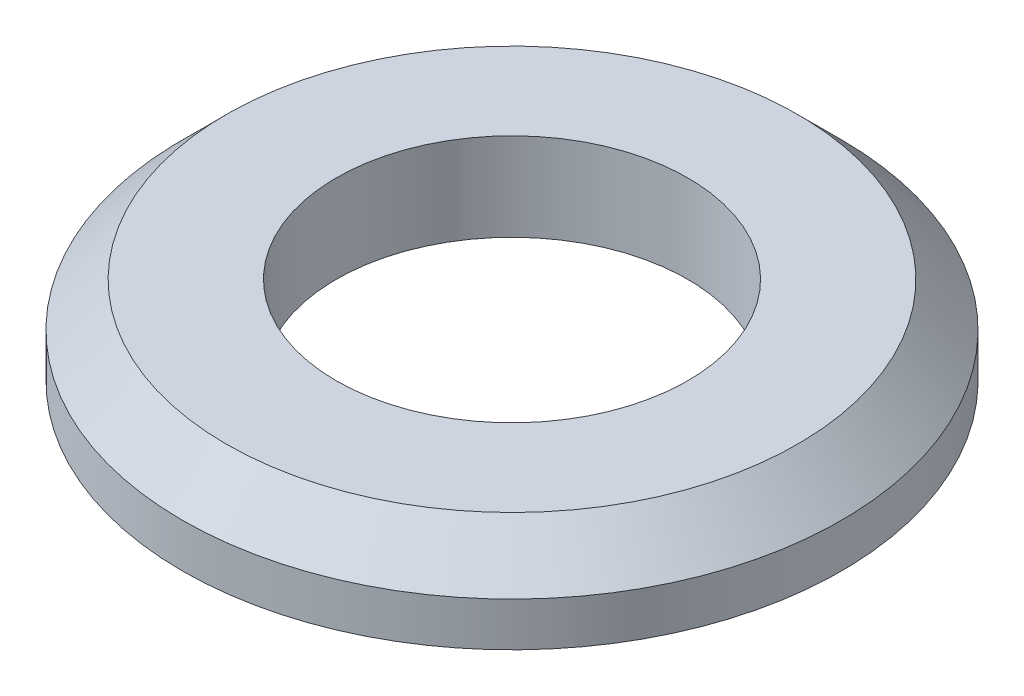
from build123d import *

# Parameters (mm, degrees)
SKETCH1_R      = 6
SKETCH1_R_2    = 3.2
EXTRUDE1_DEPTH = 1.6
CHAMFER1_SIZE  = 0.8


with BuildPart() as part:
    # Sketch1 → Extrude1 (new body)
    with BuildSketch(Plane(origin=(0, 0, 0), x_dir=(1, 0, 0), z_dir=(0, 1, 0))):
        with Locations(Location((0, 0, 0), (0, 0, 270))):
            Circle(SKETCH1_R)
        with Locations(Location((0, 0, 0), (0, 0, 270))):
            Circle(SKETCH1_R_2, mode=Mode.SUBTRACT)
    extrude(amount=EXTRUDE1_DEPTH)

    # Chamfer1
    chamfer1_edges = [part.edges().sort_by_distance(p)[0] for p in [
        (0, 1.6, -6),
    ]]
    chamfer(chamfer1_edges, length=CHAMFER1_SIZE)


solid = part.part
